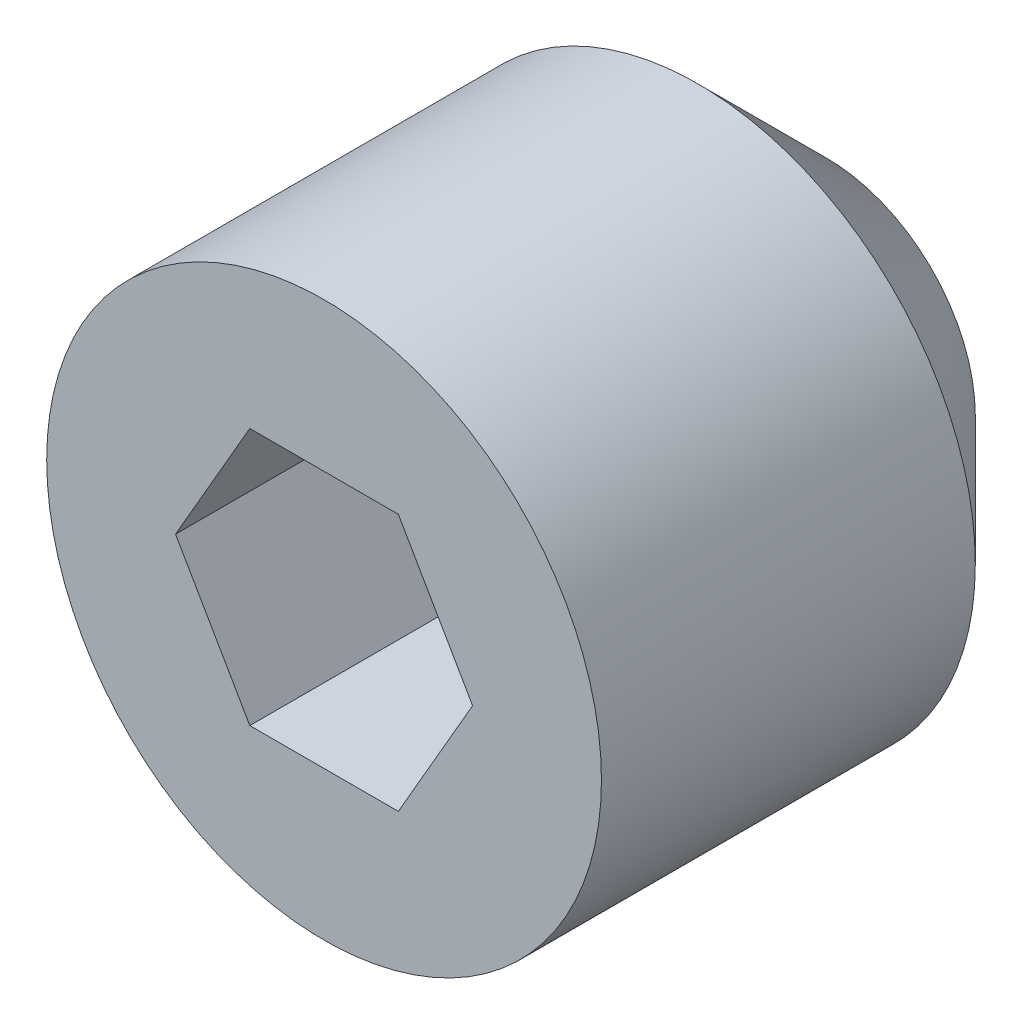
from build123d import *

# Parameters (mm, degrees)
CUT_EXTRUDE1_DEPTH = 1.27


with BuildPart() as part:
    # Sketch1 → Revolve1 (revolve)
    with BuildSketch(Plane(origin=(0, 0, 0), x_dir=(0, 0, -1), z_dir=(1, 0, 0)), mode=Mode.PRIVATE) as revolve1_sk:
        Polygon((0, 0), (0, 1.7526), (2.3622, 1.7526), (3.175, 0.9398), (3.175, 0), align=None)
    revolve(revolve1_sk.sketch.rotate(Axis((0, 0, 19.78622773), (0, 0, -1)), 90), axis=Axis((0, 0, 19.78622773), (0, 0, -1)))

    # Sketch2 → Cut-Extrude1 (cut)
    with BuildSketch(Plane.XY):
        Polygon((0.938540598, 0), (0.469270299, 0.8128), (-0.469270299, 0.8128), (-0.938540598, 0), (-0.469270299, -0.8128), (0.469270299, -0.8128), align=None)
    extrude(amount=-CUT_EXTRUDE1_DEPTH, mode=Mode.SUBTRACT)


solid = part.part
